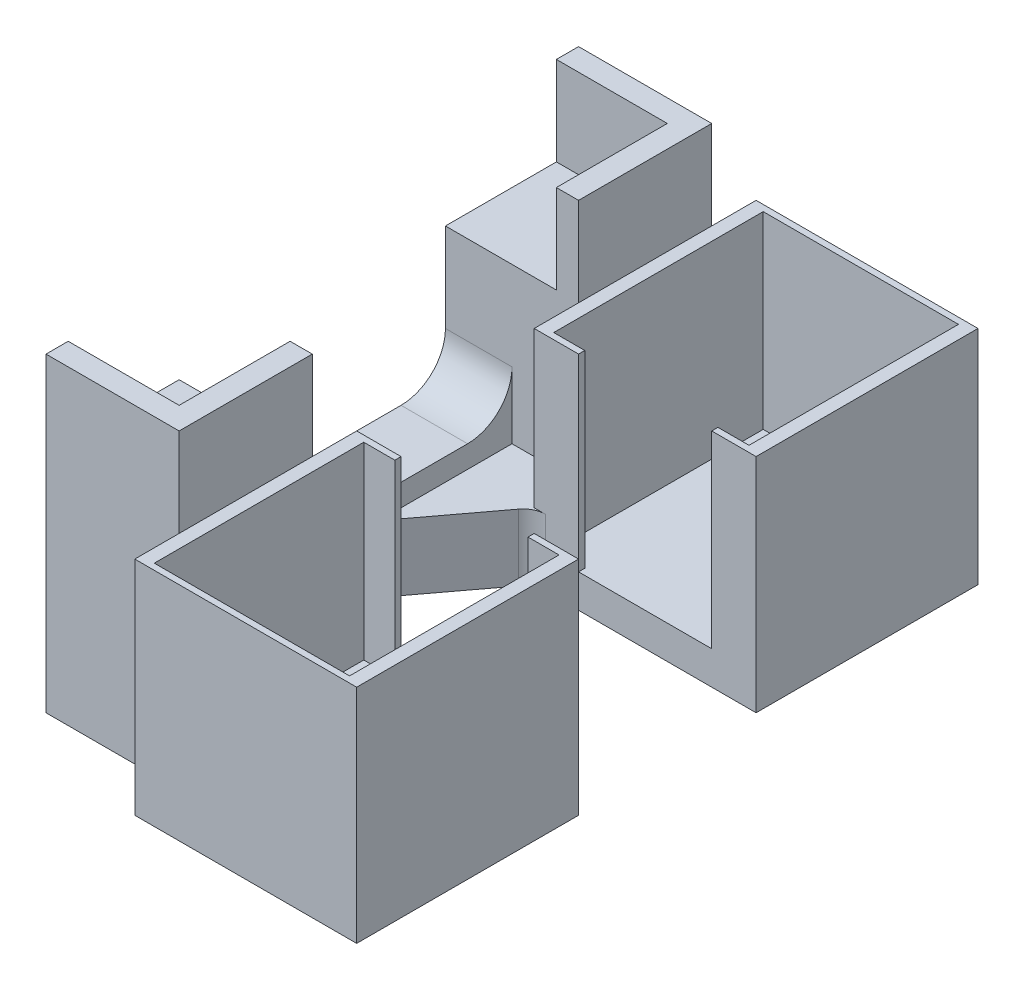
from build123d import *

# Parameters (mm, degrees)
CROQUIS1_W              = 50
CROQUIS1_H              = 50
SALIENTE_EXTRUIR1_DEPTH = 50
CORTAR_EXTRUIR1_DEPTH   = 42.5
CROQUIS5_W              = 30
CROQUIS5_H              = 50
SALIENTE_EXTRUIR3_DEPTH = 30
CROQUIS6_W              = 20
CROQUIS6_H              = 20
CORTAR_EXTRUIR3_DEPTH   = 45
CROQUIS7_W              = 30
CROQUIS7_H              = 15
SALIENTE_EXTRUIR4_DEPTH = 15
CROQUIS8_R              = 4.05
CORTAR_EXTRUIR4_DEPTH   = 10
CROQUIS9_W              = 15
CROQUIS9_H              = 30
SALIENTE_EXTRUIR5_DEPTH = 5
REDONDEO2_R             = 10
REDONDEO3_R             = 2
SALIENTE_EXTRUIR6_START = -5
SALIENTE_EXTRUIR6_DEPTH = 15
REDONDEO4_R             = 5
SALIENTE_EXTRUIR7_DEPTH = 20


with BuildPart() as part:
    # Croquis1 → Saliente-Extruir1 (new body)
    with BuildSketch(Plane.XY):
        Rectangle(CROQUIS1_W, CROQUIS1_H)
    extrude(amount=SALIENTE_EXTRUIR1_DEPTH)

    # Croquis2 → Cortar-Extruir1 (cut)
    with BuildSketch(Plane(origin=(0, 25, 0), x_dir=(1, 0, 0), z_dir=(0, 1, 0))):
        Polygon((-22, -48.6), (-15, -48.6), (-15, -50), (15, -50), (15, -48.6), (22, -48.6), (22, -1.4), (-22, -1.4), align=None)
    extrude(amount=-CORTAR_EXTRUIR1_DEPTH, mode=Mode.SUBTRACT)

    # Croquis5 → Saliente-Extruir3 (add)
    with BuildSketch(Plane.ZY.offset(25)):
        with Locations((25, 0)):
            Rectangle(CROQUIS5_W, CROQUIS5_H)
    extrude(amount=SALIENTE_EXTRUIR3_DEPTH)

    # Croquis6 → Cortar-Extruir3 (cut)
    with BuildSketch(Plane.XZ.offset(25)):
        with Locations((-40, 25)):
            Rectangle(CROQUIS6_W, CROQUIS6_H)
    extrude(amount=-CORTAR_EXTRUIR3_DEPTH, mode=Mode.SUBTRACT)

    # Croquis7 → Saliente-Extruir4 (add)
    with BuildSketch(Plane.ZY.offset(55)):
        with Locations((55, -17.5)):
            Rectangle(CROQUIS7_W, CROQUIS7_H)
    extrude(amount=-SALIENTE_EXTRUIR4_DEPTH)

    # Croquis8 → Cortar-Extruir4 (cut)
    with BuildSketch(Plane.ZY.offset(55)):
        with Locations((62.2, -15)):
            Circle(CROQUIS8_R)
    extrude(amount=-CORTAR_EXTRUIR4_DEPTH, mode=Mode.SUBTRACT)

    # Croquis9 → Saliente-Extruir5 (add)
    with BuildSketch(Plane(origin=(0, -10, 0), x_dir=(1, 0, 0), z_dir=(0, 1, 0))):
        with Locations((-47.5, -55)):
            Rectangle(CROQUIS9_W, CROQUIS9_H)
    extrude(amount=SALIENTE_EXTRUIR5_DEPTH)

    # Redondeo2
    redondeo2_edges = [part.edges().sort_by_distance(p)[0] for p in [
        (-47.5, -5, 40),
    ]]
    fillet(redondeo2_edges, radius=REDONDEO2_R)

    # Redondeo3
    redondeo3_edges = [part.edges().sort_by_distance(p)[0] for p in [
        (-55, -15, 70),
    ]]
    fillet(redondeo3_edges, radius=REDONDEO3_R)

    # Croquis10 → Saliente-Extruir6 (add)
    with BuildSketch(Plane(origin=(0, -5, 0), x_dir=(1, 0, 0), z_dir=(0, 1, 0)).offset(SALIENTE_EXTRUIR6_START)):
        Polygon((-40, -70), (-25, -50), (-25, -40), (-40, -40), align=None)
    extrude(amount=-SALIENTE_EXTRUIR6_DEPTH)

    # Redondeo4
    redondeo4_edges = [part.edges().sort_by_distance(p)[0] for p in [
        (-25, -17.5, 50),
    ]]
    fillet(redondeo4_edges, radius=REDONDEO4_R)

    # Croquis11 → Saliente-Extruir7 (add)
    with BuildSketch(Plane(origin=(0, 25, 0), x_dir=(1, 0, 0), z_dir=(0, 1, 0))):
        Polygon((-25, -10), (-25, -40), (-30, -40), (-30, -15), (-55, -15), (-55, -10), align=None)
    extrude(amount=SALIENTE_EXTRUIR7_DEPTH)


with BuildPart() as body_2:
    # Simetr_a1: mirrored copy
    add(part.part.mirror(Plane(origin=(-40, -25, 70), x_dir=(1, 0, 0), z_dir=(0, 0, 1))))


solid = Compound([part.part, body_2.part])
